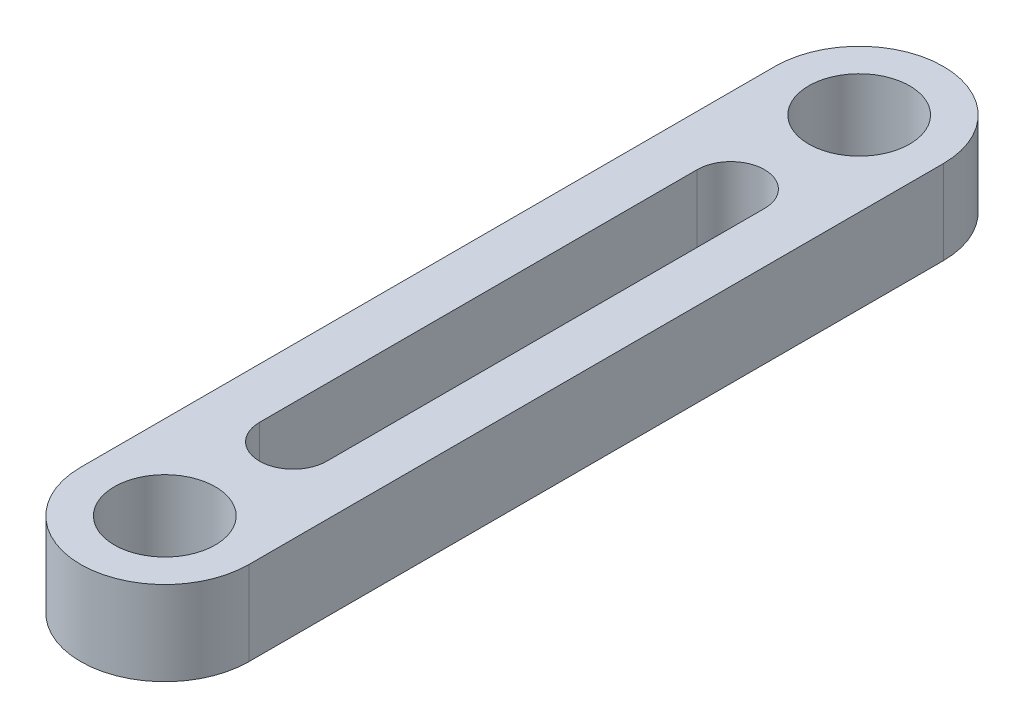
from build123d import *

# Parameters (mm, degrees)
ESQUISSE1_R      = 6
EXTRUSION1_DEPTH = 10
EXTRUSION2_DEPTH = 10


with BuildPart() as part:
    # Esquisse1 → Extrusion1 (new body)
    with BuildSketch(Plane(origin=(0, 0, 0), x_dir=(1, 0, 0), z_dir=(0, 1, 0))):
        with BuildLine():
            Line((-8.623262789, 41.25), (-8.623262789, -41.25))
            ThreePointArc((-8.623262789, -41.25), (1.376737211, -51.25), (11.376737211, -41.25))
            Line((11.376737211, -41.25), (11.376737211, 41.25))
            ThreePointArc((11.376737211, 41.25), (1.376737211, 51.25), (-8.623262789, 41.25))
        make_face()
        with Locations(Location((1.376737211, -41.25, 0), (0, 0, 270))):
            Circle(ESQUISSE1_R, mode=Mode.SUBTRACT)
        with Locations(Location((1.376737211, 41.25, 0), (0, 0, 270))):
            Circle(ESQUISSE1_R, mode=Mode.SUBTRACT)
    extrude(amount=-EXTRUSION1_DEPTH)

    # Esquisse2 → Extrusion2 (cut)
    with BuildSketch(Plane(origin=(0, 0, 0), x_dir=(-1, 0, 0), z_dir=(0, 1, 0))):
        with BuildLine():
            Line((-5.376737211, -26), (-5.376737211, 26))
            ThreePointArc((-5.376737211, 26), (-1.376737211, 30), (2.623262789, 26))
            Line((2.623262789, 26), (2.623262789, -26))
            ThreePointArc((2.623262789, -26), (-1.376737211, -30), (-5.376737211, -26))
        make_face()
    extrude(amount=-EXTRUSION2_DEPTH, mode=Mode.SUBTRACT)


solid = part.part
